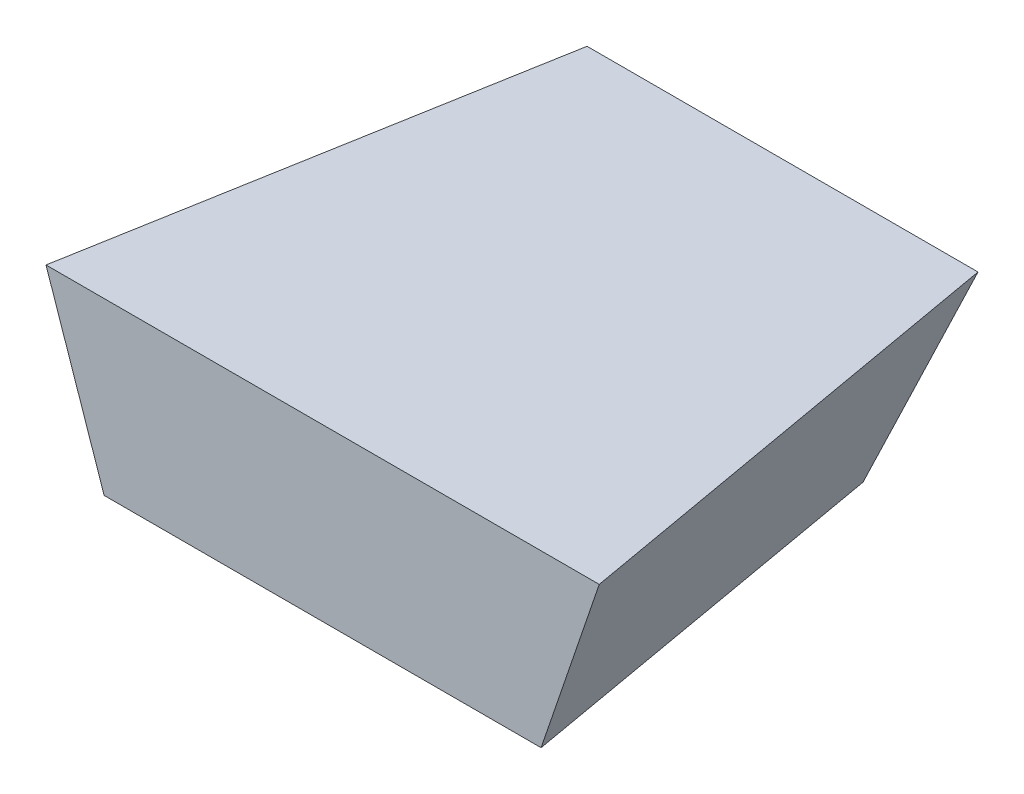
from build123d import *


with BuildPart() as part:
    # Sketch1 → Loft1 section 0
    with BuildSketch(Plane(origin=(0, 0, 0), x_dir=(1, 0, 0), z_dir=(0, 1, 0))):
        with BuildLine():
            Line((-60.325, 0), (60.325, 0))
            Line((60.325, 0), (41.275, 107.95))
            Line((41.275, 107.95), (-41.275, 107.95))
            Line((-41.275, 107.95), (-60.325, 0))
        make_face()
    # Sketch3 → Loft1 section 1
    with BuildSketch(Plane(origin=(0, 47.092860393, 0), x_dir=(1, 0, 0), z_dir=(0, 1, 0))):
        with BuildLine():
            Line((-53.975, 127), (53.975, 127))
            Line((53.975, 127), (76.386764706, 0))
            Line((76.386764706, 0), (-76.386764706, 0))
            Line((-76.386764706, 0), (-53.975, 127))
        make_face()
    loft()


solid = part.part
